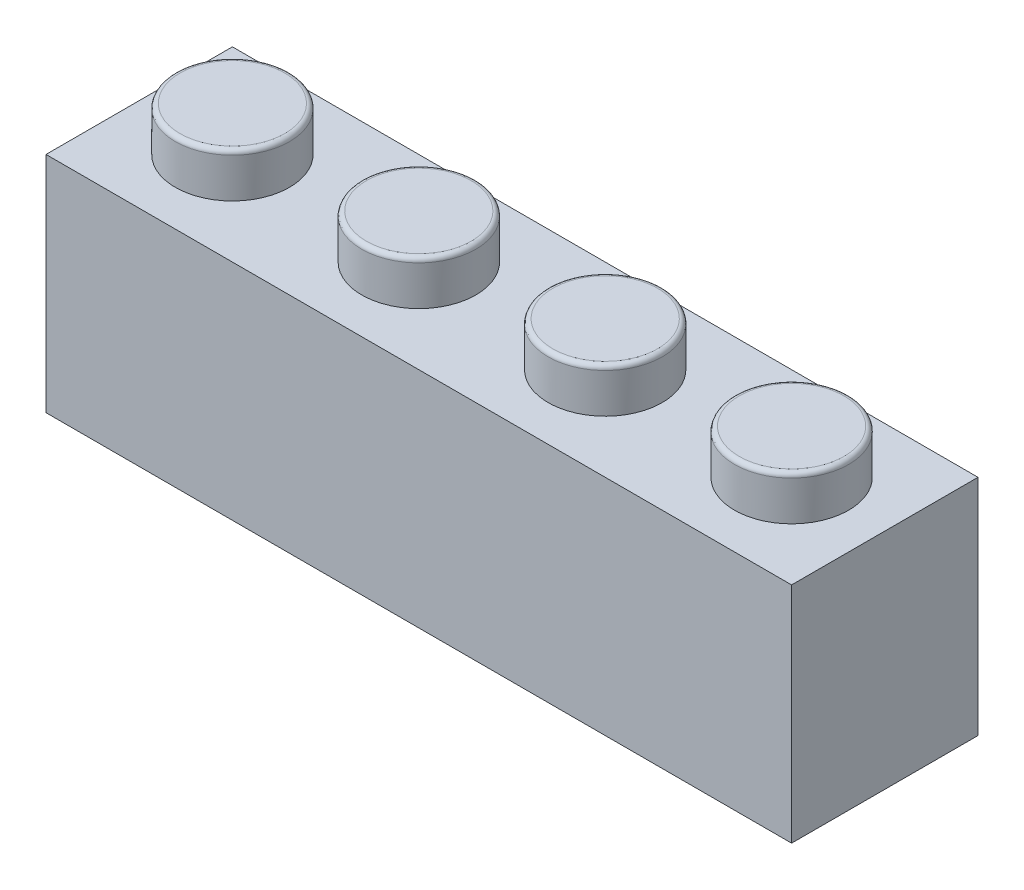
from build123d import *

# Parameters (mm, degrees)
SKIZZE1_W                         = 32
SKIZZE1_H                         = 9.6
LINEAR_AUSTRAGEN1_DEPTH           = 8
SKIZZE2_R                         = 2.45
LINEAR_AUSTRAGEN2_DEPTH           = 1.9
VERRUNDUNG1_R                     = 0.2
SKIZZE3_W                         = 28.8
SKIZZE3_H                         = 4.8
SCHNITT_LINEAR_AUSTRAGEN1_DEPTH   = 8.5
SKIZZE4_R                         = 1.6
SCHNITT_LINEAR_AUSTRAGEN2_DEPTH   = 1.8
LINEARES_MUSTER2_COUNT            = 4
LINEARES_MUSTER2_PITCH            = 8
VERRUNDUNG1_OF_LINEARES_MUSTER2_R = 0.2
SKIZZE5_R                         = 1.6
LINEAR_AUSTRAGEN3_DEPTH           = 8.4
LINEARES_MUSTER4_COUNT            = 3
LINEARES_MUSTER4_PITCH            = 8


with BuildPart() as part:
    # Skizze1 → Linear austragen1 (new body)
    with BuildSketch(Plane.XY):
        with Locations((16, 4.8)):
            Rectangle(SKIZZE1_W, SKIZZE1_H)
    extrude(amount=LINEAR_AUSTRAGEN1_DEPTH)

    # Skizze2 → Linear austragen2 (add)
    with BuildSketch(Plane(origin=(0, 9.6, 0), x_dir=(-1, 0, 0), z_dir=(0, 1, 0))):
        with Locations(Location((-4, 4, 0), (0, 0, 270))):
            Circle(SKIZZE2_R)
    linear_austragen2 = extrude(amount=LINEAR_AUSTRAGEN2_DEPTH)

    # Verrundung1
    verrundung1_edges = [part.edges().sort_by_distance(p)[0] for p in [
        (4, 11.5, 6.45),
    ]]
    fillet(verrundung1_edges, radius=VERRUNDUNG1_R)

    # Skizze3 → Schnitt-Linear austragen1 (cut)
    with BuildSketch(Plane.XZ):
        with Locations((16, 4)):
            Rectangle(SKIZZE3_W, SKIZZE3_H)
    extrude(amount=-SCHNITT_LINEAR_AUSTRAGEN1_DEPTH, mode=Mode.SUBTRACT)

    # Skizze4 → Schnitt-Linear austragen2 (cut)
    with BuildSketch(Plane.XZ.offset(-8.5)):
        with Locations(Location((4, 4, 0), (0, 0, 270))):
            Circle(SKIZZE4_R)
    schnitt_linear_austragen2 = extrude(amount=-SCHNITT_LINEAR_AUSTRAGEN2_DEPTH, mode=Mode.SUBTRACT)

    # Lineares Muster2: Linear austragen2, Schnitt-Linear austragen2 ×4
    with Locations(*[(i * LINEARES_MUSTER2_PITCH, 0, 0) for i in range(1, LINEARES_MUSTER2_COUNT)]):
        add(linear_austragen2)
        add(schnitt_linear_austragen2, mode=Mode.SUBTRACT)

    # Verrundung1 of Lineares Muster2
    verrundung1_of_lineares_muster2_edges = [part.edges().sort_by_distance(p)[0] for p in [
        (12, 11.5, 6.45),
        (20, 11.5, 6.45),
        (28, 11.5, 6.45),
    ]]
    fillet(verrundung1_of_lineares_muster2_edges, radius=VERRUNDUNG1_OF_LINEARES_MUSTER2_R)

    # Skizze5 → Linear austragen3 (add)
    with BuildSketch(Plane.XZ.offset(-8.5)):
        with Locations(Location((8, 4, 0), (0, 0, 270))):
            Circle(SKIZZE5_R)
    linear_austragen3 = extrude(amount=LINEAR_AUSTRAGEN3_DEPTH)

    # Lineares Muster4: Linear austragen3 ×3
    with Locations(*[(i * LINEARES_MUSTER4_PITCH, 0, 0) for i in range(1, LINEARES_MUSTER4_COUNT)]):
        add(linear_austragen3)


solid = part.part
